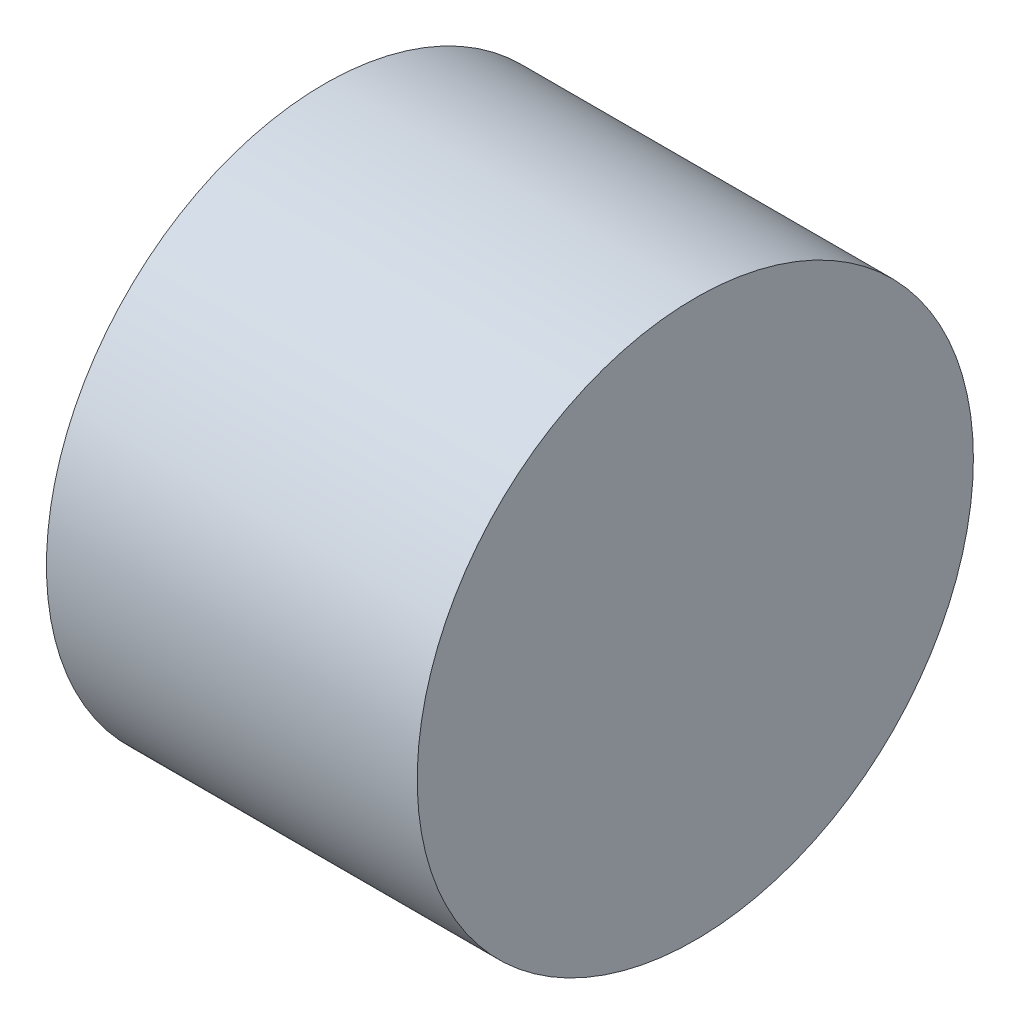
from build123d import *

# Parameters (mm, degrees)
ESQUISSE1_R      = 7.5
EXTRUSION1_DEPTH = 10


with BuildPart() as part:
    # Esquisse1 → Extrusion1 (new body)
    with BuildSketch(Plane(origin=(0, 0, 0), x_dir=(0, 0, -1), z_dir=(1, 0, 0))):
        Circle(ESQUISSE1_R)
    extrude(amount=EXTRUSION1_DEPTH)


solid = part.part
